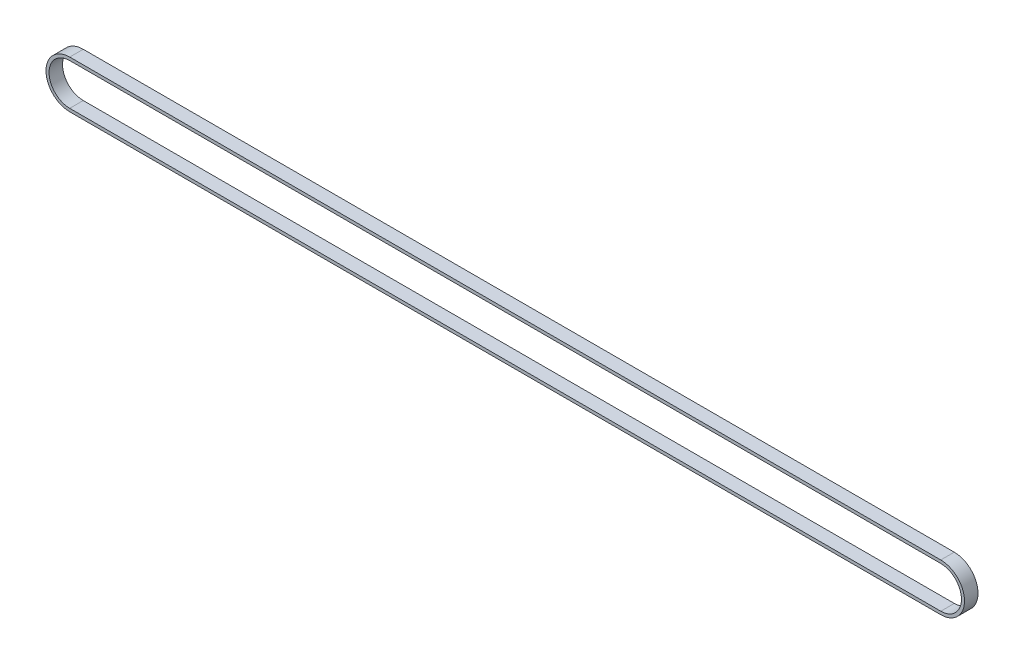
ISO-10303-21;
HEADER;
FILE_DESCRIPTION(('STEP AP214'),'2;1');
FILE_NAME('part.step','',(''),(''),'','','');
FILE_SCHEMA(('AUTOMOTIVE_DESIGN { 1 0 10303 214 1 1 1 1 }'));
ENDSEC;
DATA;
#1=APPLICATION_CONTEXT('core data for automotive mechanical design processes');
#2=APPLICATION_PROTOCOL_DEFINITION('international standard','automotive_design',2000,#1);
#3=PRODUCT_CONTEXT('',#1,'mechanical');
#4=PRODUCT('Part','Part','',(#3));
#5=PRODUCT_RELATED_PRODUCT_CATEGORY('part','',(#4));
#6=PRODUCT_DEFINITION_FORMATION('','',#4);
#7=PRODUCT_DEFINITION_CONTEXT('part definition',#1,'design');
#8=PRODUCT_DEFINITION('design','',#6,#7);
#9=PRODUCT_DEFINITION_SHAPE('','',#8);
#10=(LENGTH_UNIT() NAMED_UNIT(*) SI_UNIT(.MILLI.,.METRE.));
#11=(NAMED_UNIT(*) PLANE_ANGLE_UNIT() SI_UNIT($,.RADIAN.));
#12=(NAMED_UNIT(*) SI_UNIT($,.STERADIAN.) SOLID_ANGLE_UNIT());
#13=UNCERTAINTY_MEASURE_WITH_UNIT(LENGTH_MEASURE(1.E-05),#10,'distance_accuracy_value','');
#14=(GEOMETRIC_REPRESENTATION_CONTEXT(3) GLOBAL_UNCERTAINTY_ASSIGNED_CONTEXT((#13)) GLOBAL_UNIT_ASSIGNED_CONTEXT((#10,
#11,#12)) REPRESENTATION_CONTEXT('',''));
#15=CARTESIAN_POINT('',(0.,0.,0.));
#16=DIRECTION('',(0.,0.,1.));
#17=DIRECTION('',(1.,0.,0.));
#18=AXIS2_PLACEMENT_3D('',#15,#16,#17);
#19=CARTESIAN_POINT('',(-193.499999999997,3.33066907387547E-13,3.));
#20=DIRECTION('',(0.,0.,0.999999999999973));
#21=DIRECTION('',(0.999999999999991,0.,0.));
#22=AXIS2_PLACEMENT_3D('',#19,#20,#21);
#23=PLANE('',#22);
#24=CARTESIAN_POINT('',(-193.499999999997,3.33066907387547E-13,3.));
#25=DIRECTION('',(0.,0.,0.999999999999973));
#26=DIRECTION('',(0.999999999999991,0.,0.));
#27=AXIS2_PLACEMENT_3D('',#24,#25,#26);
#28=CIRCLE('',#27,10.541);
#29=CARTESIAN_POINT('',(-193.499999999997,10.5410000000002,2.99999999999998));
#30=VERTEX_POINT('',#29);
#31=CARTESIAN_POINT('',(-193.499999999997,-10.5409999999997,3.));
#32=VERTEX_POINT('',#31);
#33=EDGE_CURVE('E133',#30,#32,#28,.T.);
#34=ORIENTED_EDGE('',*,*,#33,.T.);
#35=DIRECTION('',(0.999999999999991,0.,0.));
#36=VECTOR('',#35,1.);
#37=CARTESIAN_POINT('',(-193.499999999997,-10.5409999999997,3.));
#38=LINE('',#37,#36);
#39=CARTESIAN_POINT('',(193.499999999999,-10.5410000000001,3.));
#40=VERTEX_POINT('',#39);
#41=EDGE_CURVE('E136',#32,#40,#38,.T.);
#42=ORIENTED_EDGE('',*,*,#41,.T.);
#43=CARTESIAN_POINT('',(193.499999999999,0.,3.));
#44=DIRECTION('',(0.,0.,0.999999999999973));
#45=DIRECTION('',(0.999999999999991,0.,0.));
#46=AXIS2_PLACEMENT_3D('',#43,#44,#45);
#47=CIRCLE('',#46,10.5410000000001);
#48=CARTESIAN_POINT('',(193.499999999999,10.5410000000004,3.));
#49=VERTEX_POINT('',#48);
#50=EDGE_CURVE('E139',#40,#49,#47,.T.);
#51=ORIENTED_EDGE('',*,*,#50,.T.);
#52=DIRECTION('',(-0.999999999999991,0.,0.));
#53=VECTOR('',#52,1.);
#54=CARTESIAN_POINT('',(-193.499999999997,10.5410000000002,2.99999999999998));
#55=LINE('',#54,#53);
#56=EDGE_CURVE('E141',#49,#30,#55,.T.);
#57=ORIENTED_EDGE('',*,*,#56,.T.);
#58=EDGE_LOOP('',(#34,#42,#51,#57));
#59=FACE_BOUND('',#58,.T.);
#60=DIRECTION('',(0.999999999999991,0.,0.));
#61=VECTOR('',#60,1.);
#62=CARTESIAN_POINT('',(-193.499999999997,-9.18099999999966,3.));
#63=LINE('',#62,#61);
#64=CARTESIAN_POINT('',(-193.499999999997,-9.18099999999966,3.));
#65=VERTEX_POINT('',#64);
#66=CARTESIAN_POINT('',(193.499999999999,-9.18099999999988,3.));
#67=VERTEX_POINT('',#66);
#68=EDGE_CURVE('E105',#65,#67,#63,.T.);
#69=ORIENTED_EDGE('',*,*,#68,.F.);
#70=CARTESIAN_POINT('',(-193.499999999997,3.33066907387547E-13,3.));
#71=DIRECTION('',(0.,0.,0.999999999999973));
#72=DIRECTION('',(0.999999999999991,0.,0.));
#73=AXIS2_PLACEMENT_3D('',#70,#71,#72);
#74=CIRCLE('',#73,9.18099999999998);
#75=CARTESIAN_POINT('',(-193.499999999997,9.18100000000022,2.99999999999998));
#76=VERTEX_POINT('',#75);
#77=EDGE_CURVE('E97',#76,#65,#74,.T.);
#78=ORIENTED_EDGE('',*,*,#77,.F.);
#79=DIRECTION('',(-0.999999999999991,0.,0.));
#80=VECTOR('',#79,1.);
#81=CARTESIAN_POINT('',(-193.499999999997,9.18100000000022,2.99999999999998));
#82=LINE('',#81,#80);
#83=CARTESIAN_POINT('',(193.499999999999,9.18099999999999,3.));
#84=VERTEX_POINT('',#83);
#85=EDGE_CURVE('E119',#84,#76,#82,.T.);
#86=ORIENTED_EDGE('',*,*,#85,.F.);
#87=CARTESIAN_POINT('',(193.499999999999,0.,3.));
#88=DIRECTION('',(0.,0.,0.999999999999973));
#89=DIRECTION('',(0.999999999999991,0.,0.));
#90=AXIS2_PLACEMENT_3D('',#87,#88,#89);
#91=CIRCLE('',#90,9.18099999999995);
#92=EDGE_CURVE('E117',#67,#84,#91,.T.);
#93=ORIENTED_EDGE('',*,*,#92,.F.);
#94=EDGE_LOOP('',(#69,#78,#86,#93));
#95=FACE_BOUND('',#94,.T.);
#96=ADVANCED_FACE('F32',(#59,#95),#23,.T.);
#97=CARTESIAN_POINT('',(-193.499999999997,3.33066907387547E-13,-3.));
#98=DIRECTION('',(0.,0.,0.999999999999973));
#99=DIRECTION('',(0.999999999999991,0.,0.));
#100=AXIS2_PLACEMENT_3D('',#97,#98,#99);
#101=PLANE('',#100);
#102=CARTESIAN_POINT('',(-193.499999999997,3.33066907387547E-13,-3.));
#103=DIRECTION('',(0.,0.,0.999999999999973));
#104=DIRECTION('',(0.999999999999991,0.,0.));
#105=AXIS2_PLACEMENT_3D('',#102,#103,#104);
#106=CIRCLE('',#105,10.541);
#107=CARTESIAN_POINT('',(-193.499999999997,10.5410000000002,-3.));
#108=VERTEX_POINT('',#107);
#109=CARTESIAN_POINT('',(-193.499999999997,-10.5409999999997,-3.));
#110=VERTEX_POINT('',#109);
#111=EDGE_CURVE('E113',#108,#110,#106,.T.);
#112=ORIENTED_EDGE('',*,*,#111,.F.);
#113=DIRECTION('',(-0.999999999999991,0.,0.));
#114=VECTOR('',#113,1.);
#115=CARTESIAN_POINT('',(-193.499999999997,10.5410000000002,-3.));
#116=LINE('',#115,#114);
#117=CARTESIAN_POINT('',(193.499999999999,10.5410000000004,-3.));
#118=VERTEX_POINT('',#117);
#119=EDGE_CURVE('E137',#118,#108,#116,.T.);
#120=ORIENTED_EDGE('',*,*,#119,.F.);
#121=CARTESIAN_POINT('',(193.499999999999,0.,-3.));
#122=DIRECTION('',(0.,0.,0.999999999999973));
#123=DIRECTION('',(0.999999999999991,0.,0.));
#124=AXIS2_PLACEMENT_3D('',#121,#122,#123);
#125=CIRCLE('',#124,10.5410000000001);
#126=CARTESIAN_POINT('',(193.499999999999,-10.5410000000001,-2.99999999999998));
#127=VERTEX_POINT('',#126);
#128=EDGE_CURVE('E148',#127,#118,#125,.T.);
#129=ORIENTED_EDGE('',*,*,#128,.F.);
#130=DIRECTION('',(0.999999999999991,0.,0.));
#131=VECTOR('',#130,1.);
#132=CARTESIAN_POINT('',(-193.499999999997,-10.5409999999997,-3.));
#133=LINE('',#132,#131);
#134=EDGE_CURVE('E146',#110,#127,#133,.T.);
#135=ORIENTED_EDGE('',*,*,#134,.F.);
#136=EDGE_LOOP('',(#112,#120,#129,#135));
#137=FACE_BOUND('',#136,.T.);
#138=CARTESIAN_POINT('',(-193.499999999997,3.33066907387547E-13,-3.));
#139=DIRECTION('',(0.,0.,0.999999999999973));
#140=DIRECTION('',(0.999999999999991,0.,0.));
#141=AXIS2_PLACEMENT_3D('',#138,#139,#140);
#142=CIRCLE('',#141,9.18099999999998);
#143=CARTESIAN_POINT('',(-193.499999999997,9.18100000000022,-3.));
#144=VERTEX_POINT('',#143);
#145=CARTESIAN_POINT('',(-193.499999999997,-9.18099999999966,-3.));
#146=VERTEX_POINT('',#145);
#147=EDGE_CURVE('E55',#144,#146,#142,.T.);
#148=ORIENTED_EDGE('',*,*,#147,.T.);
#149=DIRECTION('',(0.999999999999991,0.,0.));
#150=VECTOR('',#149,1.);
#151=CARTESIAN_POINT('',(-193.499999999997,-9.18099999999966,-3.));
#152=LINE('',#151,#150);
#153=CARTESIAN_POINT('',(193.499999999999,-9.18099999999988,-2.99999999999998));
#154=VERTEX_POINT('',#153);
#155=EDGE_CURVE('E112',#146,#154,#152,.T.);
#156=ORIENTED_EDGE('',*,*,#155,.T.);
#157=CARTESIAN_POINT('',(193.499999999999,0.,-3.));
#158=DIRECTION('',(0.,0.,0.999999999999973));
#159=DIRECTION('',(0.999999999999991,0.,0.));
#160=AXIS2_PLACEMENT_3D('',#157,#158,#159);
#161=CIRCLE('',#160,9.18099999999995);
#162=CARTESIAN_POINT('',(193.499999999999,9.18099999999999,-3.));
#163=VERTEX_POINT('',#162);
#164=EDGE_CURVE('E125',#154,#163,#161,.T.);
#165=ORIENTED_EDGE('',*,*,#164,.T.);
#166=DIRECTION('',(-0.999999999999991,0.,0.));
#167=VECTOR('',#166,1.);
#168=CARTESIAN_POINT('',(-193.499999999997,9.18100000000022,-3.));
#169=LINE('',#168,#167);
#170=EDGE_CURVE('E106',#163,#144,#169,.T.);
#171=ORIENTED_EDGE('',*,*,#170,.T.);
#172=EDGE_LOOP('',(#148,#156,#165,#171));
#173=FACE_BOUND('',#172,.T.);
#174=ADVANCED_FACE('F166',(#137,#173),#101,.F.);
#175=CARTESIAN_POINT('',(-193.499999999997,3.33066907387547E-13,3.));
#176=DIRECTION('',(0.,0.,-0.999999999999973));
#177=DIRECTION('',(-0.999999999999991,0.,0.));
#178=AXIS2_PLACEMENT_3D('',#175,#176,#177);
#179=CYLINDRICAL_SURFACE('',#178,10.541);
#180=ORIENTED_EDGE('',*,*,#111,.T.);
#181=DIRECTION('',(0.,0.,-0.999999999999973));
#182=VECTOR('',#181,1.);
#183=CARTESIAN_POINT('',(-193.499999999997,-10.5409999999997,3.));
#184=LINE('',#183,#182);
#185=EDGE_CURVE('E11',#32,#110,#184,.T.);
#186=ORIENTED_EDGE('',*,*,#185,.F.);
#187=ORIENTED_EDGE('',*,*,#33,.F.);
#188=DIRECTION('',(0.,0.,-0.999999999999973));
#189=VECTOR('',#188,1.);
#190=CARTESIAN_POINT('',(-193.499999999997,10.5410000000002,2.99999999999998));
#191=LINE('',#190,#189);
#192=EDGE_CURVE('E143',#30,#108,#191,.T.);
#193=ORIENTED_EDGE('',*,*,#192,.T.);
#194=EDGE_LOOP('',(#180,#186,#187,#193));
#195=FACE_BOUND('',#194,.T.);
#196=ADVANCED_FACE('F34',(#195),#179,.T.);
#197=CARTESIAN_POINT('',(-193.499999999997,-10.5409999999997,3.));
#198=DIRECTION('',(0.,1.,0.));
#199=DIRECTION('',(-0.999999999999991,0.,0.));
#200=AXIS2_PLACEMENT_3D('',#197,#198,#199);
#201=PLANE('',#200);
#202=ORIENTED_EDGE('',*,*,#134,.T.);
#203=DIRECTION('',(0.,0.,-0.999999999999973));
#204=VECTOR('',#203,1.);
#205=CARTESIAN_POINT('',(193.499999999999,-10.5410000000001,3.));
#206=LINE('',#205,#204);
#207=EDGE_CURVE('E40',#40,#127,#206,.T.);
#208=ORIENTED_EDGE('',*,*,#207,.F.);
#209=ORIENTED_EDGE('',*,*,#41,.F.);
#210=ORIENTED_EDGE('',*,*,#185,.T.);
#211=EDGE_LOOP('',(#202,#208,#209,#210));
#212=FACE_BOUND('',#211,.T.);
#213=ADVANCED_FACE('F176',(#212),#201,.F.);
#214=CARTESIAN_POINT('',(193.499999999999,0.,3.));
#215=DIRECTION('',(0.,0.,-0.999999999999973));
#216=DIRECTION('',(-0.999999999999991,0.,0.));
#217=AXIS2_PLACEMENT_3D('',#214,#215,#216);
#218=CYLINDRICAL_SURFACE('',#217,10.5410000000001);
#219=ORIENTED_EDGE('',*,*,#128,.T.);
#220=DIRECTION('',(0.,0.,-0.999999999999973));
#221=VECTOR('',#220,1.);
#222=CARTESIAN_POINT('',(193.499999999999,10.5410000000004,3.));
#223=LINE('',#222,#221);
#224=EDGE_CURVE('E153',#49,#118,#223,.T.);
#225=ORIENTED_EDGE('',*,*,#224,.F.);
#226=ORIENTED_EDGE('',*,*,#50,.F.);
#227=ORIENTED_EDGE('',*,*,#207,.T.);
#228=EDGE_LOOP('',(#219,#225,#226,#227));
#229=FACE_BOUND('',#228,.T.);
#230=ADVANCED_FACE('F160',(#229),#218,.T.);
#231=CARTESIAN_POINT('',(-193.499999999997,10.5410000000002,2.99999999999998));
#232=DIRECTION('',(0.,-1.,0.));
#233=DIRECTION('',(0.,0.,-0.999999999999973));
#234=AXIS2_PLACEMENT_3D('',#231,#232,#233);
#235=PLANE('',#234);
#236=ORIENTED_EDGE('',*,*,#119,.T.);
#237=ORIENTED_EDGE('',*,*,#192,.F.);
#238=ORIENTED_EDGE('',*,*,#56,.F.);
#239=ORIENTED_EDGE('',*,*,#224,.T.);
#240=EDGE_LOOP('',(#236,#237,#238,#239));
#241=FACE_BOUND('',#240,.T.);
#242=ADVANCED_FACE('F170',(#241),#235,.F.);
#243=CARTESIAN_POINT('',(-193.499999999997,3.33066907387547E-13,3.));
#244=DIRECTION('',(0.,0.,-0.999999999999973));
#245=DIRECTION('',(-0.999999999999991,0.,0.));
#246=AXIS2_PLACEMENT_3D('',#243,#244,#245);
#247=CYLINDRICAL_SURFACE('',#246,9.18099999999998);
#248=ORIENTED_EDGE('',*,*,#147,.F.);
#249=DIRECTION('',(0.,0.,-0.999999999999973));
#250=VECTOR('',#249,1.);
#251=CARTESIAN_POINT('',(-193.499999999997,9.18100000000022,2.99999999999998));
#252=LINE('',#251,#250);
#253=EDGE_CURVE('E101',#76,#144,#252,.T.);
#254=ORIENTED_EDGE('',*,*,#253,.F.);
#255=ORIENTED_EDGE('',*,*,#77,.T.);
#256=DIRECTION('',(0.,0.,-0.999999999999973));
#257=VECTOR('',#256,1.);
#258=CARTESIAN_POINT('',(-193.499999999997,-9.18099999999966,3.));
#259=LINE('',#258,#257);
#260=EDGE_CURVE('E100',#65,#146,#259,.T.);
#261=ORIENTED_EDGE('',*,*,#260,.T.);
#262=EDGE_LOOP('',(#248,#254,#255,#261));
#263=FACE_BOUND('',#262,.T.);
#264=ADVANCED_FACE('F99',(#263),#247,.F.);
#265=CARTESIAN_POINT('',(-193.499999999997,-9.18099999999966,3.));
#266=DIRECTION('',(0.,1.,0.));
#267=DIRECTION('',(-0.999999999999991,0.,0.));
#268=AXIS2_PLACEMENT_3D('',#265,#266,#267);
#269=PLANE('',#268);
#270=ORIENTED_EDGE('',*,*,#155,.F.);
#271=ORIENTED_EDGE('',*,*,#260,.F.);
#272=ORIENTED_EDGE('',*,*,#68,.T.);
#273=DIRECTION('',(0.,0.,-0.999999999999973));
#274=VECTOR('',#273,1.);
#275=CARTESIAN_POINT('',(193.499999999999,-9.18099999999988,3.));
#276=LINE('',#275,#274);
#277=EDGE_CURVE('E114',#67,#154,#276,.T.);
#278=ORIENTED_EDGE('',*,*,#277,.T.);
#279=EDGE_LOOP('',(#270,#271,#272,#278));
#280=FACE_BOUND('',#279,.T.);
#281=ADVANCED_FACE('F109',(#280),#269,.T.);
#282=CARTESIAN_POINT('',(193.499999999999,0.,3.));
#283=DIRECTION('',(0.,0.,-0.999999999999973));
#284=DIRECTION('',(-0.999999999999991,0.,0.));
#285=AXIS2_PLACEMENT_3D('',#282,#283,#284);
#286=CYLINDRICAL_SURFACE('',#285,9.18099999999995);
#287=ORIENTED_EDGE('',*,*,#164,.F.);
#288=ORIENTED_EDGE('',*,*,#277,.F.);
#289=ORIENTED_EDGE('',*,*,#92,.T.);
#290=DIRECTION('',(0.,0.,-0.999999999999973));
#291=VECTOR('',#290,1.);
#292=CARTESIAN_POINT('',(193.499999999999,9.18099999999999,3.));
#293=LINE('',#292,#291);
#294=EDGE_CURVE('E47',#84,#163,#293,.T.);
#295=ORIENTED_EDGE('',*,*,#294,.T.);
#296=EDGE_LOOP('',(#287,#288,#289,#295));
#297=FACE_BOUND('',#296,.T.);
#298=ADVANCED_FACE('F199',(#297),#286,.F.);
#299=CARTESIAN_POINT('',(-193.499999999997,9.18100000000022,2.99999999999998));
#300=DIRECTION('',(0.,-1.,0.));
#301=DIRECTION('',(0.999999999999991,0.,0.));
#302=AXIS2_PLACEMENT_3D('',#299,#300,#301);
#303=PLANE('',#302);
#304=ORIENTED_EDGE('',*,*,#170,.F.);
#305=ORIENTED_EDGE('',*,*,#294,.F.);
#306=ORIENTED_EDGE('',*,*,#85,.T.);
#307=ORIENTED_EDGE('',*,*,#253,.T.);
#308=EDGE_LOOP('',(#304,#305,#306,#307));
#309=FACE_BOUND('',#308,.T.);
#310=ADVANCED_FACE('F203',(#309),#303,.T.);
#311=CLOSED_SHELL('',(#96,#174,#196,#213,#230,#242,#264,#281,#298,#310));
#312=MANIFOLD_SOLID_BREP('B2',#311);
#313=ADVANCED_BREP_SHAPE_REPRESENTATION('',(#18,#312),#14);
#314=SHAPE_DEFINITION_REPRESENTATION(#9,#313);
ENDSEC;
END-ISO-10303-21;
